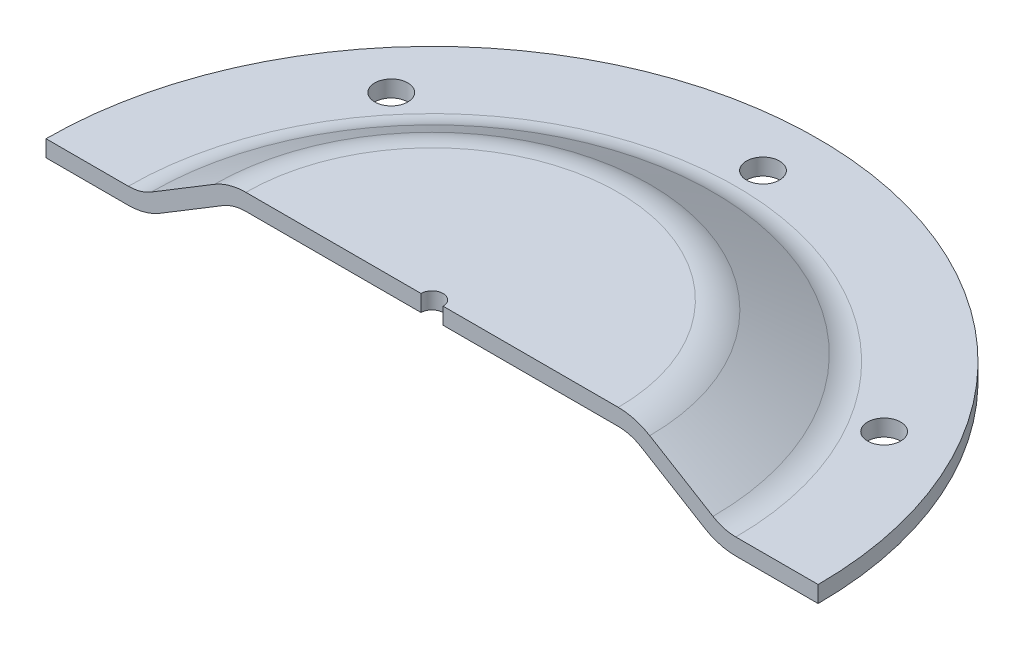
ISO-10303-21;
HEADER;
FILE_DESCRIPTION(('STEP AP214'),'2;1');
FILE_NAME('part.step','',(''),(''),'','','');
FILE_SCHEMA(('AUTOMOTIVE_DESIGN { 1 0 10303 214 1 1 1 1 }'));
ENDSEC;
DATA;
#1=APPLICATION_CONTEXT('core data for automotive mechanical design processes');
#2=APPLICATION_PROTOCOL_DEFINITION('international standard','automotive_design',2000,#1);
#3=PRODUCT_CONTEXT('',#1,'mechanical');
#4=PRODUCT('Part','Part','',(#3));
#5=PRODUCT_RELATED_PRODUCT_CATEGORY('part','',(#4));
#6=PRODUCT_DEFINITION_FORMATION('','',#4);
#7=PRODUCT_DEFINITION_CONTEXT('part definition',#1,'design');
#8=PRODUCT_DEFINITION('design','',#6,#7);
#9=PRODUCT_DEFINITION_SHAPE('','',#8);
#10=(LENGTH_UNIT() NAMED_UNIT(*) SI_UNIT(.MILLI.,.METRE.));
#11=(NAMED_UNIT(*) PLANE_ANGLE_UNIT() SI_UNIT($,.RADIAN.));
#12=(NAMED_UNIT(*) SI_UNIT($,.STERADIAN.) SOLID_ANGLE_UNIT());
#13=UNCERTAINTY_MEASURE_WITH_UNIT(LENGTH_MEASURE(1.E-05),#10,'distance_accuracy_value','');
#14=(GEOMETRIC_REPRESENTATION_CONTEXT(3) GLOBAL_UNCERTAINTY_ASSIGNED_CONTEXT((#13)) GLOBAL_UNIT_ASSIGNED_CONTEXT((#10,
#11,#12)) REPRESENTATION_CONTEXT('',''));
#15=CARTESIAN_POINT('',(0.,0.,0.));
#16=DIRECTION('',(0.,0.,1.));
#17=DIRECTION('',(1.,0.,0.));
#18=AXIS2_PLACEMENT_3D('',#15,#16,#17);
#19=CARTESIAN_POINT('',(0.,1.5,0.));
#20=DIRECTION('',(0.,-1.,0.));
#21=DIRECTION('',(0.,0.,-1.));
#22=AXIS2_PLACEMENT_3D('',#19,#20,#21);
#23=CYLINDRICAL_SURFACE('',#22,35.);
#24=DIRECTION('',(0.,1.,0.));
#25=VECTOR('',#24,1.);
#26=CARTESIAN_POINT('',(-35.,-4.84999999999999,-2.44403835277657E-13));
#27=LINE('',#26,#25);
#28=CARTESIAN_POINT('',(-35.,-4.84999999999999,-2.44403835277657E-13));
#29=VERTEX_POINT('',#28);
#30=CARTESIAN_POINT('',(-35.,-3.34999999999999,-2.44403835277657E-13));
#31=VERTEX_POINT('',#30);
#32=EDGE_CURVE('E127',#29,#31,#27,.T.);
#33=ORIENTED_EDGE('',*,*,#32,.T.);
#34=CARTESIAN_POINT('',(0.,-3.34999999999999,0.));
#35=DIRECTION('',(0.,-1.,0.));
#36=DIRECTION('',(0.,0.,-1.));
#37=AXIS2_PLACEMENT_3D('',#34,#35,#36);
#38=CIRCLE('',#37,35.);
#39=CARTESIAN_POINT('',(35.,-3.34999999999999,0.));
#40=VERTEX_POINT('',#39);
#41=EDGE_CURVE('E136',#31,#40,#38,.T.);
#42=ORIENTED_EDGE('',*,*,#41,.T.);
#43=DIRECTION('',(0.,1.,0.));
#44=VECTOR('',#43,1.);
#45=CARTESIAN_POINT('',(35.,-4.84999999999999,0.));
#46=LINE('',#45,#44);
#47=CARTESIAN_POINT('',(35.,-4.84999999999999,0.));
#48=VERTEX_POINT('',#47);
#49=EDGE_CURVE('E119',#48,#40,#46,.T.);
#50=ORIENTED_EDGE('',*,*,#49,.F.);
#51=CARTESIAN_POINT('',(0.,-4.84999999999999,0.));
#52=DIRECTION('',(0.,-1.,0.));
#53=DIRECTION('',(0.,0.,-1.));
#54=AXIS2_PLACEMENT_3D('',#51,#52,#53);
#55=CIRCLE('',#54,35.);
#56=EDGE_CURVE('E134',#29,#48,#55,.T.);
#57=ORIENTED_EDGE('',*,*,#56,.F.);
#58=EDGE_LOOP('',(#33,#42,#50,#57));
#59=FACE_BOUND('',#58,.T.);
#60=ADVANCED_FACE('F31',(#59),#23,.T.);
#61=CARTESIAN_POINT('',(-35.,-3.34999999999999,0.));
#62=DIRECTION('',(0.,-1.,0.));
#63=DIRECTION('',(0.,0.,-1.));
#64=AXIS2_PLACEMENT_3D('',#61,#62,#63);
#65=PLANE('',#64);
#66=CARTESIAN_POINT('',(0.,-3.35000000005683,-30.));
#67=DIRECTION('',(0.,1.,0.));
#68=DIRECTION('',(0.,0.,1.));
#69=AXIS2_PLACEMENT_3D('',#66,#67,#68);
#70=CIRCLE('',#69,1.5);
#71=CARTESIAN_POINT('',(0.,-3.35000000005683,-28.5));
#72=VERTEX_POINT('',#71);
#73=EDGE_CURVE('E146',#72,#72,#70,.T.);
#74=ORIENTED_EDGE('',*,*,#73,.F.);
#75=EDGE_LOOP('',(#74));
#76=FACE_BOUND('',#75,.T.);
#77=CARTESIAN_POINT('',(25.9807621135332,-3.35000000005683,-15.));
#78=DIRECTION('',(0.,1.,0.));
#79=DIRECTION('',(-0.866025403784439,0.,0.499999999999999));
#80=AXIS2_PLACEMENT_3D('',#77,#78,#79);
#81=CIRCLE('',#80,1.5);
#82=CARTESIAN_POINT('',(24.6817240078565,-3.35000000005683,-14.25));
#83=VERTEX_POINT('',#82);
#84=EDGE_CURVE('E201',#83,#83,#81,.T.);
#85=ORIENTED_EDGE('',*,*,#84,.F.);
#86=EDGE_LOOP('',(#85));
#87=FACE_BOUND('',#86,.T.);
#88=CARTESIAN_POINT('',(-22.9813332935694,-3.35000000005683,-19.2836282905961));
#89=DIRECTION('',(0.,1.,0.));
#90=DIRECTION('',(0.766044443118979,0.,0.642787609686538));
#91=AXIS2_PLACEMENT_3D('',#88,#89,#90);
#92=CIRCLE('',#91,1.5);
#93=CARTESIAN_POINT('',(-21.8322666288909,-3.35000000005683,-18.3194468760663));
#94=VERTEX_POINT('',#93);
#95=EDGE_CURVE('E188',#94,#94,#92,.T.);
#96=ORIENTED_EDGE('',*,*,#95,.F.);
#97=EDGE_LOOP('',(#96));
#98=FACE_BOUND('',#97,.T.);
#99=DIRECTION('',(-1.,0.,0.));
#100=VECTOR('',#99,1.);
#101=CARTESIAN_POINT('',(-35.,-3.34999999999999,-2.44403835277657E-13));
#102=LINE('',#101,#100);
#103=CARTESIAN_POINT('',(27.5369903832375,-3.34999999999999,1.92289887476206E-13));
#104=VERTEX_POINT('',#103);
#105=EDGE_CURVE('E192',#40,#104,#102,.T.);
#106=ORIENTED_EDGE('',*,*,#105,.F.);
#107=ORIENTED_EDGE('',*,*,#41,.F.);
#108=CARTESIAN_POINT('',(-27.5369903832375,-3.34999999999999,-1.92289887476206E-13));
#109=VERTEX_POINT('',#108);
#110=EDGE_CURVE('E186',#109,#31,#102,.T.);
#111=ORIENTED_EDGE('',*,*,#110,.F.);
#112=CARTESIAN_POINT('',(0.,-3.34999999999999,0.));
#113=DIRECTION('',(0.,-1.,0.));
#114=DIRECTION('',(0.,0.,-1.));
#115=AXIS2_PLACEMENT_3D('',#112,#113,#114);
#116=CIRCLE('',#115,27.5369903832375);
#117=EDGE_CURVE('E167',#109,#104,#116,.T.);
#118=ORIENTED_EDGE('',*,*,#117,.T.);
#119=EDGE_LOOP('',(#106,#107,#111,#118));
#120=FACE_BOUND('',#119,.T.);
#121=ADVANCED_FACE('F212',(#76,#87,#98,#120),#65,.F.);
#122=CARTESIAN_POINT('',(0.,0.65000000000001,0.));
#123=DIRECTION('',(0.,-1.,0.));
#124=DIRECTION('',(0.,0.,-1.));
#125=AXIS2_PLACEMENT_3D('',#122,#123,#124);
#126=TOROIDAL_SURFACE('',#125,27.5369903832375,4.);
#127=CARTESIAN_POINT('',(-27.5369903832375,0.65000000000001,-1.92289887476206E-13));
#128=DIRECTION('',(0.,0.,1.));
#129=DIRECTION('',(1.,0.,0.));
#130=AXIS2_PLACEMENT_3D('',#127,#128,#129);
#131=CIRCLE('',#130,4.);
#132=CARTESIAN_POINT('',(-25.4633097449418,-2.77050414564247,-1.77809444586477E-13));
#133=VERTEX_POINT('',#132);
#134=EDGE_CURVE('E190',#133,#109,#131,.F.);
#135=ORIENTED_EDGE('',*,*,#134,.F.);
#136=CARTESIAN_POINT('',(0.,-2.77050414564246,0.));
#137=DIRECTION('',(0.,-1.,0.));
#138=DIRECTION('',(0.,0.,-1.));
#139=AXIS2_PLACEMENT_3D('',#136,#137,#138);
#140=CIRCLE('',#139,25.4633097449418);
#141=CARTESIAN_POINT('',(25.4633097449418,-2.77050414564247,1.77809444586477E-13));
#142=VERTEX_POINT('',#141);
#143=EDGE_CURVE('E164',#133,#142,#140,.T.);
#144=ORIENTED_EDGE('',*,*,#143,.T.);
#145=CARTESIAN_POINT('',(27.5369903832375,0.65000000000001,1.92289887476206E-13));
#146=DIRECTION('',(0.,0.,1.));
#147=DIRECTION('',(1.,0.,0.));
#148=AXIS2_PLACEMENT_3D('',#145,#146,#147);
#149=CIRCLE('',#148,4.);
#150=EDGE_CURVE('E224',#104,#142,#149,.F.);
#151=ORIENTED_EDGE('',*,*,#150,.F.);
#152=ORIENTED_EDGE('',*,*,#117,.F.);
#153=EDGE_LOOP('',(#135,#144,#151,#152));
#154=FACE_BOUND('',#153,.T.);
#155=ADVANCED_FACE('F215',(#154),#126,.F.);
#156=CARTESIAN_POINT('',(0.,0.703193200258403,0.));
#157=DIRECTION('',(0.,-1.,0.));
#158=DIRECTION('',(0.,0.,-1.));
#159=AXIS2_PLACEMENT_3D('',#156,#157,#158);
#160=CONICAL_SURFACE('',#159,19.7334996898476,1.02579390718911);
#161=DIRECTION('',(-0.855126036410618,-0.518420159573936,0.));
#162=VECTOR('',#161,1.);
#163=CARTESIAN_POINT('',(0.,12.6666273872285,0.));
#164=LINE('',#163,#162);
#165=CARTESIAN_POINT('',(-19.7334996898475,0.703193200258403,-1.3779837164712E-13));
#166=VERTEX_POINT('',#165);
#167=EDGE_CURVE('E225',#166,#133,#164,.T.);
#168=ORIENTED_EDGE('',*,*,#167,.F.);
#169=CARTESIAN_POINT('',(0.,0.703193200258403,0.));
#170=DIRECTION('',(0.,-1.,0.));
#171=DIRECTION('',(0.,0.,-1.));
#172=AXIS2_PLACEMENT_3D('',#169,#170,#171);
#173=CIRCLE('',#172,19.7334996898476);
#174=CARTESIAN_POINT('',(19.7334996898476,0.703193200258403,1.3779837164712E-13));
#175=VERTEX_POINT('',#174);
#176=EDGE_CURVE('E161',#166,#175,#173,.T.);
#177=ORIENTED_EDGE('',*,*,#176,.T.);
#178=DIRECTION('',(-0.855126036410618,0.518420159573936,0.));
#179=VECTOR('',#178,1.);
#180=CARTESIAN_POINT('',(0.,12.6666273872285,0.));
#181=LINE('',#180,#179);
#182=EDGE_CURVE('E227',#142,#175,#181,.T.);
#183=ORIENTED_EDGE('',*,*,#182,.F.);
#184=ORIENTED_EDGE('',*,*,#143,.F.);
#185=EDGE_LOOP('',(#168,#177,#183,#184));
#186=FACE_BOUND('',#185,.T.);
#187=ADVANCED_FACE('F237',(#186),#160,.T.);
#188=CARTESIAN_POINT('',(0.,-4.,0.));
#189=DIRECTION('',(0.,-1.,0.));
#190=DIRECTION('',(0.,0.,-1.));
#191=AXIS2_PLACEMENT_3D('',#188,#189,#190);
#192=TOROIDAL_SURFACE('',#191,16.8821888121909,5.5);
#193=CARTESIAN_POINT('',(-16.8821888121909,-4.,-1.17887762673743E-13));
#194=DIRECTION('',(0.,0.,1.));
#195=DIRECTION('',(1.,0.,0.));
#196=AXIS2_PLACEMENT_3D('',#193,#194,#195);
#197=CIRCLE('',#196,5.5);
#198=CARTESIAN_POINT('',(-16.8821888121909,1.5,-1.17887762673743E-13));
#199=VERTEX_POINT('',#198);
#200=EDGE_CURVE('E223',#199,#166,#197,.T.);
#201=ORIENTED_EDGE('',*,*,#200,.F.);
#202=CARTESIAN_POINT('',(0.,1.5,0.));
#203=DIRECTION('',(0.,-1.,0.));
#204=DIRECTION('',(0.,0.,-1.));
#205=AXIS2_PLACEMENT_3D('',#202,#203,#204);
#206=CIRCLE('',#205,16.8821888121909);
#207=CARTESIAN_POINT('',(16.8821888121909,1.5,1.17887762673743E-13));
#208=VERTEX_POINT('',#207);
#209=EDGE_CURVE('E158',#199,#208,#206,.T.);
#210=ORIENTED_EDGE('',*,*,#209,.T.);
#211=CARTESIAN_POINT('',(16.8821888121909,-4.,1.17887762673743E-13));
#212=DIRECTION('',(0.,0.,1.));
#213=DIRECTION('',(1.,0.,0.));
#214=AXIS2_PLACEMENT_3D('',#211,#212,#213);
#215=CIRCLE('',#214,5.5);
#216=EDGE_CURVE('E239',#175,#208,#215,.T.);
#217=ORIENTED_EDGE('',*,*,#216,.F.);
#218=ORIENTED_EDGE('',*,*,#176,.F.);
#219=EDGE_LOOP('',(#201,#210,#217,#218));
#220=FACE_BOUND('',#219,.T.);
#221=ADVANCED_FACE('F279',(#220),#192,.T.);
#222=CARTESIAN_POINT('',(-16.8821888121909,1.5,0.));
#223=DIRECTION('',(0.,-1.,0.));
#224=DIRECTION('',(0.,0.,-1.));
#225=AXIS2_PLACEMENT_3D('',#222,#223,#224);
#226=PLANE('',#225);
#227=DIRECTION('',(1.,0.,0.));
#228=VECTOR('',#227,1.);
#229=CARTESIAN_POINT('',(0.,1.5,0.));
#230=LINE('',#229,#228);
#231=CARTESIAN_POINT('',(1.,1.5,0.));
#232=VERTEX_POINT('',#231);
#233=EDGE_CURVE('E52',#232,#208,#230,.T.);
#234=ORIENTED_EDGE('',*,*,#233,.T.);
#235=ORIENTED_EDGE('',*,*,#209,.F.);
#236=CARTESIAN_POINT('',(-0.999999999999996,1.5,0.));
#237=VERTEX_POINT('',#236);
#238=EDGE_CURVE('E172',#199,#237,#230,.T.);
#239=ORIENTED_EDGE('',*,*,#238,.T.);
#240=CARTESIAN_POINT('',(0.,1.5,0.));
#241=DIRECTION('',(0.,1.,0.));
#242=DIRECTION('',(0.,0.,1.));
#243=AXIS2_PLACEMENT_3D('',#240,#241,#242);
#244=CIRCLE('',#243,1.);
#245=EDGE_CURVE('E182',#232,#237,#244,.T.);
#246=ORIENTED_EDGE('',*,*,#245,.F.);
#247=EDGE_LOOP('',(#234,#235,#239,#246));
#248=FACE_BOUND('',#247,.T.);
#249=ADVANCED_FACE('F181',(#248),#226,.F.);
#250=CARTESIAN_POINT('',(0.,0.,0.));
#251=DIRECTION('',(0.,1.,0.));
#252=DIRECTION('',(0.,0.,1.));
#253=AXIS2_PLACEMENT_3D('',#250,#251,#252);
#254=PLANE('',#253);
#255=DIRECTION('',(1.,0.,0.));
#256=VECTOR('',#255,1.);
#257=CARTESIAN_POINT('',(0.,0.,0.));
#258=LINE('',#257,#256);
#259=CARTESIAN_POINT('',(-16.8821888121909,0.,-1.17887762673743E-13));
#260=VERTEX_POINT('',#259);
#261=CARTESIAN_POINT('',(-0.999999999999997,0.,0.));
#262=VERTEX_POINT('',#261);
#263=EDGE_CURVE('E45',#260,#262,#258,.T.);
#264=ORIENTED_EDGE('',*,*,#263,.F.);
#265=CARTESIAN_POINT('',(0.,0.,0.));
#266=DIRECTION('',(0.,-1.,0.));
#267=DIRECTION('',(0.,0.,-1.));
#268=AXIS2_PLACEMENT_3D('',#265,#266,#267);
#269=CIRCLE('',#268,16.8821888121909);
#270=CARTESIAN_POINT('',(16.8821888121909,0.,1.17887762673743E-13));
#271=VERTEX_POINT('',#270);
#272=EDGE_CURVE('E155',#260,#271,#269,.T.);
#273=ORIENTED_EDGE('',*,*,#272,.T.);
#274=CARTESIAN_POINT('',(1.,0.,0.));
#275=VERTEX_POINT('',#274);
#276=EDGE_CURVE('E247',#275,#271,#258,.T.);
#277=ORIENTED_EDGE('',*,*,#276,.F.);
#278=CARTESIAN_POINT('',(0.,0.,0.));
#279=DIRECTION('',(0.,1.,0.));
#280=DIRECTION('',(0.,0.,1.));
#281=AXIS2_PLACEMENT_3D('',#278,#279,#280);
#282=CIRCLE('',#281,1.);
#283=EDGE_CURVE('E185',#262,#275,#282,.F.);
#284=ORIENTED_EDGE('',*,*,#283,.F.);
#285=EDGE_LOOP('',(#264,#273,#277,#284));
#286=FACE_BOUND('',#285,.T.);
#287=ADVANCED_FACE('F271',(#286),#254,.F.);
#288=CARTESIAN_POINT('',(0.,-4.,0.));
#289=DIRECTION('',(0.,-1.,0.));
#290=DIRECTION('',(0.,0.,-1.));
#291=AXIS2_PLACEMENT_3D('',#288,#289,#290);
#292=TOROIDAL_SURFACE('',#291,16.8821888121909,4.);
#293=CARTESIAN_POINT('',(-16.8821888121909,-4.,-1.17887762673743E-13));
#294=DIRECTION('',(0.,0.,1.));
#295=DIRECTION('',(1.,0.,0.));
#296=AXIS2_PLACEMENT_3D('',#293,#294,#295);
#297=CIRCLE('',#296,4.);
#298=CARTESIAN_POINT('',(-18.9558694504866,-0.579495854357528,-1.32368205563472E-13));
#299=VERTEX_POINT('',#298);
#300=EDGE_CURVE('E252',#299,#260,#297,.F.);
#301=ORIENTED_EDGE('',*,*,#300,.F.);
#302=CARTESIAN_POINT('',(0.,-0.579495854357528,0.));
#303=DIRECTION('',(0.,-1.,0.));
#304=DIRECTION('',(0.,0.,-1.));
#305=AXIS2_PLACEMENT_3D('',#302,#303,#304);
#306=CIRCLE('',#305,18.9558694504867);
#307=CARTESIAN_POINT('',(18.9558694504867,-0.579495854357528,1.32368205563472E-13));
#308=VERTEX_POINT('',#307);
#309=EDGE_CURVE('E152',#299,#308,#306,.T.);
#310=ORIENTED_EDGE('',*,*,#309,.T.);
#311=CARTESIAN_POINT('',(16.8821888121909,-4.,1.17887762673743E-13));
#312=DIRECTION('',(0.,0.,1.));
#313=DIRECTION('',(1.,0.,0.));
#314=AXIS2_PLACEMENT_3D('',#311,#312,#313);
#315=CIRCLE('',#314,4.);
#316=EDGE_CURVE('E245',#271,#308,#315,.F.);
#317=ORIENTED_EDGE('',*,*,#316,.F.);
#318=ORIENTED_EDGE('',*,*,#272,.F.);
#319=EDGE_LOOP('',(#301,#310,#317,#318));
#320=FACE_BOUND('',#319,.T.);
#321=ADVANCED_FACE('F267',(#320),#292,.F.);
#322=CARTESIAN_POINT('',(0.,-4.0531932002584,0.));
#323=DIRECTION('',(0.,-1.,0.));
#324=DIRECTION('',(0.,0.,-1.));
#325=AXIS2_PLACEMENT_3D('',#322,#323,#324);
#326=CONICAL_SURFACE('',#325,24.6856795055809,1.02579390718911);
#327=DIRECTION('',(-0.855126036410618,-0.518420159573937,0.));
#328=VECTOR('',#327,1.);
#329=CARTESIAN_POINT('',(0.,10.9125,0.));
#330=LINE('',#329,#328);
#331=CARTESIAN_POINT('',(-24.6856795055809,-4.0531932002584,-1.72379278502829E-13));
#332=VERTEX_POINT('',#331);
#333=EDGE_CURVE('E250',#332,#299,#330,.F.);
#334=ORIENTED_EDGE('',*,*,#333,.F.);
#335=CARTESIAN_POINT('',(0.,-4.0531932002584,0.));
#336=DIRECTION('',(0.,-1.,0.));
#337=DIRECTION('',(0.,0.,-1.));
#338=AXIS2_PLACEMENT_3D('',#335,#336,#337);
#339=CIRCLE('',#338,24.6856795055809);
#340=CARTESIAN_POINT('',(24.6856795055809,-4.0531932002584,1.72379278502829E-13));
#341=VERTEX_POINT('',#340);
#342=EDGE_CURVE('E143',#332,#341,#339,.T.);
#343=ORIENTED_EDGE('',*,*,#342,.T.);
#344=DIRECTION('',(-0.855126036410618,0.518420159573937,0.));
#345=VECTOR('',#344,1.);
#346=CARTESIAN_POINT('',(0.,10.9125,0.));
#347=LINE('',#346,#345);
#348=EDGE_CURVE('E243',#308,#341,#347,.F.);
#349=ORIENTED_EDGE('',*,*,#348,.F.);
#350=ORIENTED_EDGE('',*,*,#309,.F.);
#351=EDGE_LOOP('',(#334,#343,#349,#350));
#352=FACE_BOUND('',#351,.T.);
#353=ADVANCED_FACE('F262',(#352),#326,.F.);
#354=CARTESIAN_POINT('',(0.,0.65000000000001,0.));
#355=DIRECTION('',(0.,-1.,0.));
#356=DIRECTION('',(0.,0.,-1.));
#357=AXIS2_PLACEMENT_3D('',#354,#355,#356);
#358=TOROIDAL_SURFACE('',#357,27.5369903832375,5.50000000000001);
#359=CARTESIAN_POINT('',(-27.5369903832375,0.65000000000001,-1.92289887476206E-13));
#360=DIRECTION('',(0.,0.,1.));
#361=DIRECTION('',(1.,0.,0.));
#362=AXIS2_PLACEMENT_3D('',#359,#360,#361);
#363=CIRCLE('',#362,5.50000000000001);
#364=CARTESIAN_POINT('',(-27.5369903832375,-4.84999999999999,-1.92289887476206E-13));
#365=VERTEX_POINT('',#364);
#366=EDGE_CURVE('E248',#365,#332,#363,.T.);
#367=ORIENTED_EDGE('',*,*,#366,.F.);
#368=CARTESIAN_POINT('',(0.,-4.85,0.));
#369=DIRECTION('',(0.,-1.,0.));
#370=DIRECTION('',(0.,0.,-1.));
#371=AXIS2_PLACEMENT_3D('',#368,#369,#370);
#372=CIRCLE('',#371,27.5369903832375);
#373=CARTESIAN_POINT('',(27.5369903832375,-4.84999999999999,1.92289887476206E-13));
#374=VERTEX_POINT('',#373);
#375=EDGE_CURVE('E140',#365,#374,#372,.T.);
#376=ORIENTED_EDGE('',*,*,#375,.T.);
#377=CARTESIAN_POINT('',(27.5369903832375,0.65000000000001,1.92289887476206E-13));
#378=DIRECTION('',(0.,0.,1.));
#379=DIRECTION('',(1.,0.,0.));
#380=AXIS2_PLACEMENT_3D('',#377,#378,#379);
#381=CIRCLE('',#380,5.50000000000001);
#382=EDGE_CURVE('E122',#341,#374,#381,.T.);
#383=ORIENTED_EDGE('',*,*,#382,.F.);
#384=ORIENTED_EDGE('',*,*,#342,.F.);
#385=EDGE_LOOP('',(#367,#376,#383,#384));
#386=FACE_BOUND('',#385,.T.);
#387=ADVANCED_FACE('F259',(#386),#358,.T.);
#388=CARTESIAN_POINT('',(-27.5369903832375,-4.84999999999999,0.));
#389=DIRECTION('',(0.,1.,0.));
#390=DIRECTION('',(0.,0.,1.));
#391=AXIS2_PLACEMENT_3D('',#388,#389,#390);
#392=PLANE('',#391);
#393=CARTESIAN_POINT('',(0.,-4.84999999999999,-30.));
#394=DIRECTION('',(0.,1.,0.));
#395=DIRECTION('',(0.,0.,1.));
#396=AXIS2_PLACEMENT_3D('',#393,#394,#395);
#397=CIRCLE('',#396,1.5);
#398=CARTESIAN_POINT('',(0.,-4.84999999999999,-28.5));
#399=VERTEX_POINT('',#398);
#400=EDGE_CURVE('E141',#399,#399,#397,.F.);
#401=ORIENTED_EDGE('',*,*,#400,.F.);
#402=EDGE_LOOP('',(#401));
#403=FACE_BOUND('',#402,.T.);
#404=CARTESIAN_POINT('',(25.9807621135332,-4.84999999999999,-15.));
#405=DIRECTION('',(0.,1.,0.));
#406=DIRECTION('',(0.,0.,1.));
#407=AXIS2_PLACEMENT_3D('',#404,#405,#406);
#408=CIRCLE('',#407,1.5);
#409=CARTESIAN_POINT('',(25.9807621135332,-4.84999999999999,-13.5));
#410=VERTEX_POINT('',#409);
#411=EDGE_CURVE('E204',#410,#410,#408,.F.);
#412=ORIENTED_EDGE('',*,*,#411,.F.);
#413=EDGE_LOOP('',(#412));
#414=FACE_BOUND('',#413,.T.);
#415=CARTESIAN_POINT('',(-22.9813332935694,-4.84999999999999,-19.2836282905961));
#416=DIRECTION('',(0.,1.,0.));
#417=DIRECTION('',(0.,0.,1.));
#418=AXIS2_PLACEMENT_3D('',#415,#416,#417);
#419=CIRCLE('',#418,1.5);
#420=CARTESIAN_POINT('',(-22.9813332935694,-4.84999999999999,-17.7836282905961));
#421=VERTEX_POINT('',#420);
#422=EDGE_CURVE('E198',#421,#421,#419,.F.);
#423=ORIENTED_EDGE('',*,*,#422,.F.);
#424=EDGE_LOOP('',(#423));
#425=FACE_BOUND('',#424,.T.);
#426=DIRECTION('',(-1.,0.,0.));
#427=VECTOR('',#426,1.);
#428=CARTESIAN_POINT('',(0.,-4.84999999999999,0.));
#429=LINE('',#428,#427);
#430=EDGE_CURVE('E128',#365,#29,#429,.T.);
#431=ORIENTED_EDGE('',*,*,#430,.T.);
#432=ORIENTED_EDGE('',*,*,#56,.T.);
#433=EDGE_CURVE('E116',#48,#374,#429,.T.);
#434=ORIENTED_EDGE('',*,*,#433,.T.);
#435=ORIENTED_EDGE('',*,*,#375,.F.);
#436=EDGE_LOOP('',(#431,#432,#434,#435));
#437=FACE_BOUND('',#436,.T.);
#438=ADVANCED_FACE('F139',(#403,#414,#425,#437),#392,.F.);
#439=CARTESIAN_POINT('',(0.,-4.851,0.));
#440=DIRECTION('',(0.,1.,0.));
#441=DIRECTION('',(0.,0.,1.));
#442=AXIS2_PLACEMENT_3D('',#439,#440,#441);
#443=CYLINDRICAL_SURFACE('',#442,1.);
#444=DIRECTION('',(0.,1.,0.));
#445=VECTOR('',#444,1.);
#446=CARTESIAN_POINT('',(1.,-4.851,0.));
#447=LINE('',#446,#445);
#448=EDGE_CURVE('E11',#232,#275,#447,.F.);
#449=ORIENTED_EDGE('',*,*,#448,.F.);
#450=ORIENTED_EDGE('',*,*,#245,.T.);
#451=DIRECTION('',(0.,1.,0.));
#452=VECTOR('',#451,1.);
#453=CARTESIAN_POINT('',(-0.999999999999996,-4.851,0.));
#454=LINE('',#453,#452);
#455=EDGE_CURVE('E38',#262,#237,#454,.T.);
#456=ORIENTED_EDGE('',*,*,#455,.F.);
#457=ORIENTED_EDGE('',*,*,#283,.T.);
#458=EDGE_LOOP('',(#449,#450,#456,#457));
#459=FACE_BOUND('',#458,.T.);
#460=ADVANCED_FACE('F184',(#459),#443,.F.);
#461=CARTESIAN_POINT('',(0.,-4.85099999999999,-30.));
#462=DIRECTION('',(0.,1.,0.));
#463=DIRECTION('',(0.,0.,1.));
#464=AXIS2_PLACEMENT_3D('',#461,#462,#463);
#465=CYLINDRICAL_SURFACE('',#464,1.5);
#466=ORIENTED_EDGE('',*,*,#73,.T.);
#467=EDGE_LOOP('',(#466));
#468=FACE_BOUND('',#467,.T.);
#469=ORIENTED_EDGE('',*,*,#400,.T.);
#470=EDGE_LOOP('',(#469));
#471=FACE_BOUND('',#470,.T.);
#472=ADVANCED_FACE('F209',(#468,#471),#465,.F.);
#473=CARTESIAN_POINT('',(25.9807621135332,-4.85099999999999,-15.));
#474=DIRECTION('',(0.,1.,0.));
#475=DIRECTION('',(0.,0.,1.));
#476=AXIS2_PLACEMENT_3D('',#473,#474,#475);
#477=CYLINDRICAL_SURFACE('',#476,1.5);
#478=ORIENTED_EDGE('',*,*,#84,.T.);
#479=EDGE_LOOP('',(#478));
#480=FACE_BOUND('',#479,.T.);
#481=ORIENTED_EDGE('',*,*,#411,.T.);
#482=EDGE_LOOP('',(#481));
#483=FACE_BOUND('',#482,.T.);
#484=ADVANCED_FACE('F384',(#480,#483),#477,.F.);
#485=CARTESIAN_POINT('',(-22.9813332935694,-4.85099999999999,-19.2836282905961));
#486=DIRECTION('',(0.,1.,0.));
#487=DIRECTION('',(0.,0.,1.));
#488=AXIS2_PLACEMENT_3D('',#485,#486,#487);
#489=CYLINDRICAL_SURFACE('',#488,1.5);
#490=ORIENTED_EDGE('',*,*,#95,.T.);
#491=EDGE_LOOP('',(#490));
#492=FACE_BOUND('',#491,.T.);
#493=ORIENTED_EDGE('',*,*,#422,.T.);
#494=EDGE_LOOP('',(#493));
#495=FACE_BOUND('',#494,.T.);
#496=ADVANCED_FACE('F366',(#492,#495),#489,.F.);
#497=CARTESIAN_POINT('',(0.,1.5,0.));
#498=DIRECTION('',(0.,0.,1.));
#499=DIRECTION('',(1.,0.,0.));
#500=AXIS2_PLACEMENT_3D('',#497,#498,#499);
#501=PLANE('',#500);
#502=ORIENTED_EDGE('',*,*,#110,.T.);
#503=ORIENTED_EDGE('',*,*,#32,.F.);
#504=ORIENTED_EDGE('',*,*,#430,.F.);
#505=ORIENTED_EDGE('',*,*,#366,.T.);
#506=ORIENTED_EDGE('',*,*,#333,.T.);
#507=ORIENTED_EDGE('',*,*,#300,.T.);
#508=ORIENTED_EDGE('',*,*,#263,.T.);
#509=ORIENTED_EDGE('',*,*,#455,.T.);
#510=ORIENTED_EDGE('',*,*,#238,.F.);
#511=ORIENTED_EDGE('',*,*,#200,.T.);
#512=ORIENTED_EDGE('',*,*,#167,.T.);
#513=ORIENTED_EDGE('',*,*,#134,.T.);
#514=EDGE_LOOP('',(#502,#503,#504,#505,#506,#507,#508,#509,#510,#511,#512,#513));
#515=FACE_BOUND('',#514,.T.);
#516=ADVANCED_FACE('F171',(#515),#501,.T.);
#517=ORIENTED_EDGE('',*,*,#105,.T.);
#518=ORIENTED_EDGE('',*,*,#150,.T.);
#519=ORIENTED_EDGE('',*,*,#182,.T.);
#520=ORIENTED_EDGE('',*,*,#216,.T.);
#521=ORIENTED_EDGE('',*,*,#233,.F.);
#522=ORIENTED_EDGE('',*,*,#448,.T.);
#523=ORIENTED_EDGE('',*,*,#276,.T.);
#524=ORIENTED_EDGE('',*,*,#316,.T.);
#525=ORIENTED_EDGE('',*,*,#348,.T.);
#526=ORIENTED_EDGE('',*,*,#382,.T.);
#527=ORIENTED_EDGE('',*,*,#433,.F.);
#528=ORIENTED_EDGE('',*,*,#49,.T.);
#529=EDGE_LOOP('',(#517,#518,#519,#520,#521,#522,#523,#524,#525,#526,#527,#528));
#530=FACE_BOUND('',#529,.T.);
#531=ADVANCED_FACE('F118',(#530),#501,.T.);
#532=CLOSED_SHELL('',(#60,#121,#155,#187,#221,#249,#287,#321,#353,#387,#438,#460,#472,#484,#496,
#516,#531));
#533=MANIFOLD_SOLID_BREP('B2',#532);
#534=ADVANCED_BREP_SHAPE_REPRESENTATION('',(#18,#533),#14);
#535=SHAPE_DEFINITION_REPRESENTATION(#9,#534);
ENDSEC;
END-ISO-10303-21;
